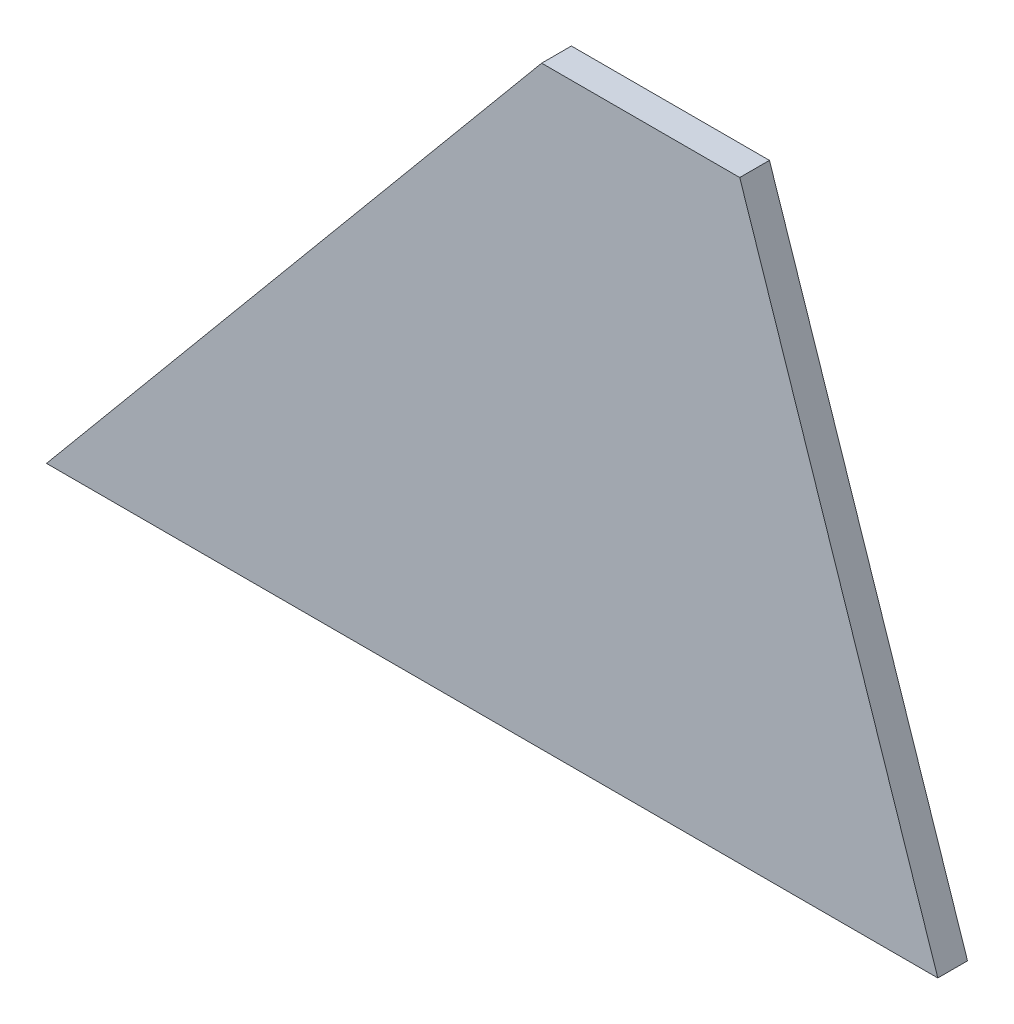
from build123d import *

# Parameters (mm, degrees)
EXTRUDE1_DEPTH = 3.81


with BuildPart() as part:
    # Sketch4 → Extrude1 (new body)
    with BuildSketch(Plane.XY):
        Polygon((107.338515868, 111.154032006), (18.438515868, 111.154032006), (81.938515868, 187.354032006), (107.338515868, 187.354032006), (132.738515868, 111.154032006), align=None)
    extrude(amount=EXTRUDE1_DEPTH)


solid = part.part
